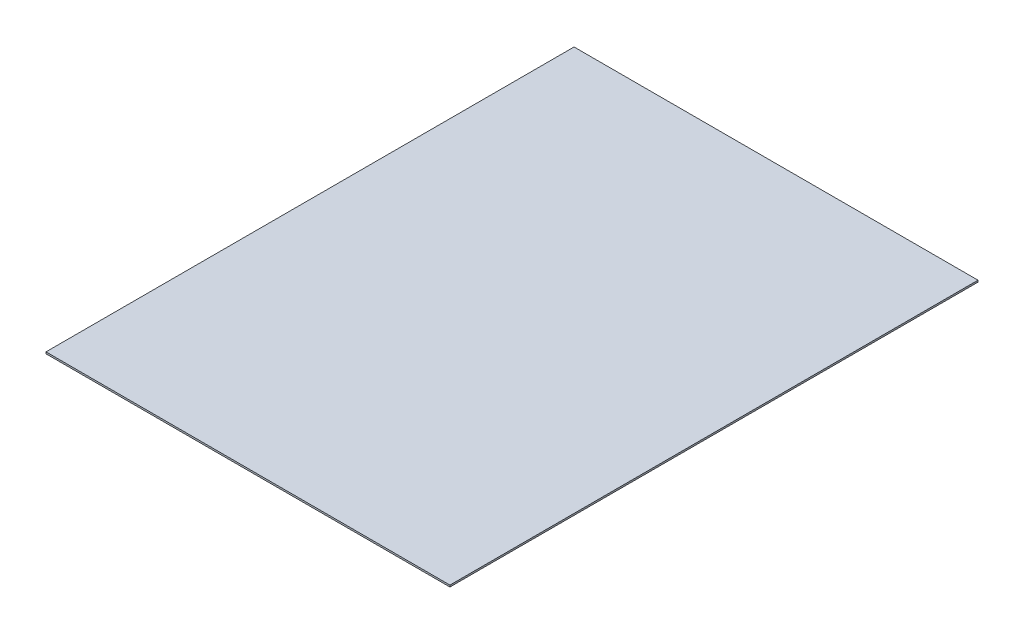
ISO-10303-21;
HEADER;
FILE_DESCRIPTION(('STEP AP214'),'2;1');
FILE_NAME('part.step','',(''),(''),'','','');
FILE_SCHEMA(('AUTOMOTIVE_DESIGN { 1 0 10303 214 1 1 1 1 }'));
ENDSEC;
DATA;
#1=APPLICATION_CONTEXT('core data for automotive mechanical design processes');
#2=APPLICATION_PROTOCOL_DEFINITION('international standard','automotive_design',2000,#1);
#3=PRODUCT_CONTEXT('',#1,'mechanical');
#4=PRODUCT('Part','Part','',(#3));
#5=PRODUCT_RELATED_PRODUCT_CATEGORY('part','',(#4));
#6=PRODUCT_DEFINITION_FORMATION('','',#4);
#7=PRODUCT_DEFINITION_CONTEXT('part definition',#1,'design');
#8=PRODUCT_DEFINITION('design','',#6,#7);
#9=PRODUCT_DEFINITION_SHAPE('','',#8);
#10=(LENGTH_UNIT() NAMED_UNIT(*) SI_UNIT(.MILLI.,.METRE.));
#11=(NAMED_UNIT(*) PLANE_ANGLE_UNIT() SI_UNIT($,.RADIAN.));
#12=(NAMED_UNIT(*) SI_UNIT($,.STERADIAN.) SOLID_ANGLE_UNIT());
#13=UNCERTAINTY_MEASURE_WITH_UNIT(LENGTH_MEASURE(1.E-05),#10,'distance_accuracy_value','');
#14=(GEOMETRIC_REPRESENTATION_CONTEXT(3) GLOBAL_UNCERTAINTY_ASSIGNED_CONTEXT((#13)) GLOBAL_UNIT_ASSIGNED_CONTEXT((#10,
#11,#12)) REPRESENTATION_CONTEXT('',''));
#15=CARTESIAN_POINT('',(0.,0.,0.));
#16=DIRECTION('',(0.,0.,1.));
#17=DIRECTION('',(1.,0.,0.));
#18=AXIS2_PLACEMENT_3D('',#15,#16,#17);
#19=CARTESIAN_POINT('',(-5900.27156701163,-100.,13001.9167430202));
#20=DIRECTION('',(-1.,0.,0.));
#21=DIRECTION('',(0.,0.,1.));
#22=AXIS2_PLACEMENT_3D('',#19,#20,#21);
#23=PLANE('',#22);
#24=DIRECTION('',(0.,0.,1.));
#25=VECTOR('',#24,1.);
#26=CARTESIAN_POINT('',(-5900.27156701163,0.,13001.9167430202));
#27=LINE('',#26,#25);
#28=CARTESIAN_POINT('',(-5900.27156701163,0.,-17755.0810203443));
#29=VERTEX_POINT('',#28);
#30=CARTESIAN_POINT('',(-5900.27156701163,0.,13001.9167430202));
#31=VERTEX_POINT('',#30);
#32=EDGE_CURVE('E104',#29,#31,#27,.T.);
#33=ORIENTED_EDGE('',*,*,#32,.F.);
#34=DIRECTION('',(0.,1.,0.));
#35=VECTOR('',#34,1.);
#36=CARTESIAN_POINT('',(-5900.27156701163,-100.,-17755.0810203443));
#37=LINE('',#36,#35);
#38=CARTESIAN_POINT('',(-5900.27156701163,-100.,-17755.0810203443));
#39=VERTEX_POINT('',#38);
#40=EDGE_CURVE('E11',#39,#29,#37,.T.);
#41=ORIENTED_EDGE('',*,*,#40,.F.);
#42=DIRECTION('',(0.,0.,1.));
#43=VECTOR('',#42,1.);
#44=CARTESIAN_POINT('',(-5900.27156701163,-100.,13001.9167430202));
#45=LINE('',#44,#43);
#46=CARTESIAN_POINT('',(-5900.27156701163,-100.,13001.9167430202));
#47=VERTEX_POINT('',#46);
#48=EDGE_CURVE('E98',#39,#47,#45,.T.);
#49=ORIENTED_EDGE('',*,*,#48,.T.);
#50=DIRECTION('',(0.,1.,0.));
#51=VECTOR('',#50,1.);
#52=CARTESIAN_POINT('',(-5900.27156701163,-100.,13001.9167430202));
#53=LINE('',#52,#51);
#54=EDGE_CURVE('E43',#47,#31,#53,.T.);
#55=ORIENTED_EDGE('',*,*,#54,.T.);
#56=EDGE_LOOP('',(#33,#41,#49,#55));
#57=FACE_BOUND('',#56,.T.);
#58=ADVANCED_FACE('F40',(#57),#23,.T.);
#59=CARTESIAN_POINT('',(-5900.27156701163,-100.,-17755.0810203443));
#60=DIRECTION('',(0.,0.,-1.));
#61=DIRECTION('',(-1.,0.,0.));
#62=AXIS2_PLACEMENT_3D('',#59,#60,#61);
#63=PLANE('',#62);
#64=DIRECTION('',(-1.,0.,0.));
#65=VECTOR('',#64,1.);
#66=CARTESIAN_POINT('',(-5900.27156701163,0.,-17755.0810203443));
#67=LINE('',#66,#65);
#68=CARTESIAN_POINT('',(17626.7811530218,0.,-17755.0810203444));
#69=VERTEX_POINT('',#68);
#70=EDGE_CURVE('E100',#69,#29,#67,.T.);
#71=ORIENTED_EDGE('',*,*,#70,.F.);
#72=DIRECTION('',(0.,1.,0.));
#73=VECTOR('',#72,1.);
#74=CARTESIAN_POINT('',(17626.7811530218,-100.,-17755.0810203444));
#75=LINE('',#74,#73);
#76=CARTESIAN_POINT('',(17626.7811530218,-100.,-17755.0810203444));
#77=VERTEX_POINT('',#76);
#78=EDGE_CURVE('E49',#77,#69,#75,.T.);
#79=ORIENTED_EDGE('',*,*,#78,.F.);
#80=DIRECTION('',(-1.,0.,0.));
#81=VECTOR('',#80,1.);
#82=CARTESIAN_POINT('',(-5900.27156701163,-100.,-17755.0810203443));
#83=LINE('',#82,#81);
#84=EDGE_CURVE('E95',#77,#39,#83,.T.);
#85=ORIENTED_EDGE('',*,*,#84,.T.);
#86=ORIENTED_EDGE('',*,*,#40,.T.);
#87=EDGE_LOOP('',(#71,#79,#85,#86));
#88=FACE_BOUND('',#87,.T.);
#89=ADVANCED_FACE('F114',(#88),#63,.T.);
#90=CARTESIAN_POINT('',(17626.7811530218,-100.,13001.9167430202));
#91=DIRECTION('',(1.,0.,0.));
#92=DIRECTION('',(0.,0.,-1.));
#93=AXIS2_PLACEMENT_3D('',#90,#91,#92);
#94=PLANE('',#93);
#95=DIRECTION('',(0.,0.,-1.));
#96=VECTOR('',#95,1.);
#97=CARTESIAN_POINT('',(17626.7811530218,0.,13001.9167430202));
#98=LINE('',#97,#96);
#99=CARTESIAN_POINT('',(17626.7811530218,0.,13001.9167430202));
#100=VERTEX_POINT('',#99);
#101=EDGE_CURVE('E90',#100,#69,#98,.T.);
#102=ORIENTED_EDGE('',*,*,#101,.F.);
#103=DIRECTION('',(0.,1.,0.));
#104=VECTOR('',#103,1.);
#105=CARTESIAN_POINT('',(17626.7811530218,-100.,13001.9167430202));
#106=LINE('',#105,#104);
#107=CARTESIAN_POINT('',(17626.7811530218,-100.,13001.9167430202));
#108=VERTEX_POINT('',#107);
#109=EDGE_CURVE('E85',#108,#100,#106,.T.);
#110=ORIENTED_EDGE('',*,*,#109,.F.);
#111=DIRECTION('',(0.,0.,-1.));
#112=VECTOR('',#111,1.);
#113=CARTESIAN_POINT('',(17626.7811530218,-100.,13001.9167430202));
#114=LINE('',#113,#112);
#115=EDGE_CURVE('E88',#108,#77,#114,.T.);
#116=ORIENTED_EDGE('',*,*,#115,.T.);
#117=ORIENTED_EDGE('',*,*,#78,.T.);
#118=EDGE_LOOP('',(#102,#110,#116,#117));
#119=FACE_BOUND('',#118,.T.);
#120=ADVANCED_FACE('F87',(#119),#94,.T.);
#121=CARTESIAN_POINT('',(-5900.27156701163,-100.,13001.9167430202));
#122=DIRECTION('',(0.,0.,1.));
#123=DIRECTION('',(1.,0.,0.));
#124=AXIS2_PLACEMENT_3D('',#121,#122,#123);
#125=PLANE('',#124);
#126=DIRECTION('',(1.,0.,0.));
#127=VECTOR('',#126,1.);
#128=CARTESIAN_POINT('',(-5900.27156701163,0.,13001.9167430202));
#129=LINE('',#128,#127);
#130=EDGE_CURVE('E107',#31,#100,#129,.T.);
#131=ORIENTED_EDGE('',*,*,#130,.F.);
#132=ORIENTED_EDGE('',*,*,#54,.F.);
#133=DIRECTION('',(1.,0.,0.));
#134=VECTOR('',#133,1.);
#135=CARTESIAN_POINT('',(-5900.27156701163,-100.,13001.9167430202));
#136=LINE('',#135,#134);
#137=EDGE_CURVE('E94',#47,#108,#136,.T.);
#138=ORIENTED_EDGE('',*,*,#137,.T.);
#139=ORIENTED_EDGE('',*,*,#109,.T.);
#140=EDGE_LOOP('',(#131,#132,#138,#139));
#141=FACE_BOUND('',#140,.T.);
#142=ADVANCED_FACE('F97',(#141),#125,.T.);
#143=CARTESIAN_POINT('',(0.,-100.,0.));
#144=DIRECTION('',(0.,-1.,0.));
#145=DIRECTION('',(0.,0.,-1.));
#146=AXIS2_PLACEMENT_3D('',#143,#144,#145);
#147=PLANE('',#146);
#148=ORIENTED_EDGE('',*,*,#48,.F.);
#149=ORIENTED_EDGE('',*,*,#84,.F.);
#150=ORIENTED_EDGE('',*,*,#115,.F.);
#151=ORIENTED_EDGE('',*,*,#137,.F.);
#152=EDGE_LOOP('',(#148,#149,#150,#151));
#153=FACE_BOUND('',#152,.T.);
#154=ADVANCED_FACE('F93',(#153),#147,.T.);
#155=CARTESIAN_POINT('',(0.,0.,0.));
#156=DIRECTION('',(0.,-1.,0.));
#157=DIRECTION('',(0.,0.,-1.));
#158=AXIS2_PLACEMENT_3D('',#155,#156,#157);
#159=PLANE('',#158);
#160=ORIENTED_EDGE('',*,*,#32,.T.);
#161=ORIENTED_EDGE('',*,*,#130,.T.);
#162=ORIENTED_EDGE('',*,*,#101,.T.);
#163=ORIENTED_EDGE('',*,*,#70,.T.);
#164=EDGE_LOOP('',(#160,#161,#162,#163));
#165=FACE_BOUND('',#164,.T.);
#166=ADVANCED_FACE('F113',(#165),#159,.F.);
#167=CLOSED_SHELL('',(#58,#89,#120,#142,#154,#166));
#168=MANIFOLD_SOLID_BREP('B2',#167);
#169=ADVANCED_BREP_SHAPE_REPRESENTATION('',(#18,#168),#14);
#170=SHAPE_DEFINITION_REPRESENTATION(#9,#169);
ENDSEC;
END-ISO-10303-21;
